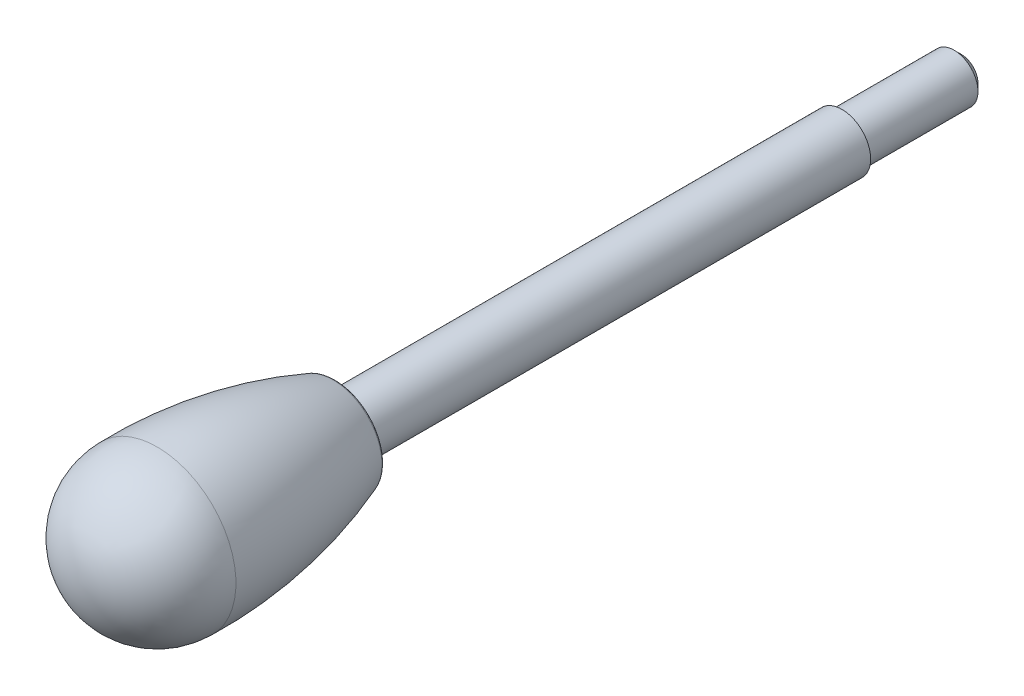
ISO-10303-21;
HEADER;
FILE_DESCRIPTION(('STEP AP214'),'2;1');
FILE_NAME('part.step','',(''),(''),'','','');
FILE_SCHEMA(('AUTOMOTIVE_DESIGN { 1 0 10303 214 1 1 1 1 }'));
ENDSEC;
DATA;
#1=APPLICATION_CONTEXT('core data for automotive mechanical design processes');
#2=APPLICATION_PROTOCOL_DEFINITION('international standard','automotive_design',2000,#1);
#3=PRODUCT_CONTEXT('',#1,'mechanical');
#4=PRODUCT('Part','Part','',(#3));
#5=PRODUCT_RELATED_PRODUCT_CATEGORY('part','',(#4));
#6=PRODUCT_DEFINITION_FORMATION('','',#4);
#7=PRODUCT_DEFINITION_CONTEXT('part definition',#1,'design');
#8=PRODUCT_DEFINITION('design','',#6,#7);
#9=PRODUCT_DEFINITION_SHAPE('','',#8);
#10=(LENGTH_UNIT() NAMED_UNIT(*) SI_UNIT(.MILLI.,.METRE.));
#11=(NAMED_UNIT(*) PLANE_ANGLE_UNIT() SI_UNIT($,.RADIAN.));
#12=(NAMED_UNIT(*) SI_UNIT($,.STERADIAN.) SOLID_ANGLE_UNIT());
#13=UNCERTAINTY_MEASURE_WITH_UNIT(LENGTH_MEASURE(1.E-05),#10,'distance_accuracy_value','');
#14=(GEOMETRIC_REPRESENTATION_CONTEXT(3) GLOBAL_UNCERTAINTY_ASSIGNED_CONTEXT((#13)) GLOBAL_UNIT_ASSIGNED_CONTEXT((#10,
#11,#12)) REPRESENTATION_CONTEXT('',''));
#15=CARTESIAN_POINT('',(0.,0.,0.));
#16=DIRECTION('',(0.,0.,1.));
#17=DIRECTION('',(1.,0.,0.));
#18=AXIS2_PLACEMENT_3D('',#15,#16,#17);
#19=CARTESIAN_POINT('',(0.,0.,143.5));
#20=DIRECTION('',(-1.,0.,0.));
#21=DIRECTION('',(0.,0.,1.));
#22=AXIS2_PLACEMENT_3D('',#19,#20,#21);
#23=SPHERICAL_SURFACE('',#22,16.5);
#24=CARTESIAN_POINT('',(0.,0.,143.5));
#25=DIRECTION('',(0.,0.,-1.));
#26=DIRECTION('',(-1.,0.,0.));
#27=AXIS2_PLACEMENT_3D('',#24,#25,#26);
#28=SPHERICAL_SURFACE('',#27,16.5);
#29=CARTESIAN_POINT('',(0.,0.,143.5));
#30=DIRECTION('',(0.,0.,-1.));
#31=DIRECTION('',(-1.,0.,0.));
#32=AXIS2_PLACEMENT_3D('',#29,#30,#31);
#33=CIRCLE('',#32,16.5);
#34=CARTESIAN_POINT('',(-16.5,0.,143.5));
#35=VERTEX_POINT('',#34);
#36=EDGE_CURVE('E8',#35,#35,#33,.T.);
#37=ORIENTED_EDGE('',*,*,#36,.F.);
#38=EDGE_LOOP('',(#37));
#39=FACE_BOUND('',#38,.T.);
#40=ADVANCED_FACE('F12',(#39),#28,.T.);
#41=CARTESIAN_POINT('',(0.,0.,141.603564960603));
#42=DIRECTION('',(0.,0.,-1.));
#43=DIRECTION('',(-1.,0.,0.));
#44=AXIS2_PLACEMENT_3D('',#41,#42,#43);
#45=DEGENERATE_TOROIDAL_SURFACE('',#44,83.9821055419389,100.5,.F.);
#46=CARTESIAN_POINT('',(0.,0.,106.652225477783));
#47=DIRECTION('',(0.,0.,-1.));
#48=DIRECTION('',(-1.,0.,0.));
#49=AXIS2_PLACEMENT_3D('',#46,#47,#48);
#50=CIRCLE('',#49,10.2445035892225);
#51=CARTESIAN_POINT('',(-10.2445035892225,0.,106.652225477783));
#52=VERTEX_POINT('',#51);
#53=EDGE_CURVE('E18',#52,#52,#50,.T.);
#54=ORIENTED_EDGE('',*,*,#53,.F.);
#55=EDGE_LOOP('',(#54));
#56=FACE_BOUND('',#55,.T.);
#57=ORIENTED_EDGE('',*,*,#36,.T.);
#58=EDGE_LOOP('',(#57));
#59=FACE_BOUND('',#58,.T.);
#60=ADVANCED_FACE('F78',(#56,#59),#45,.F.);
#61=CARTESIAN_POINT('',(0.,0.,107.));
#62=DIRECTION('',(0.,0.,-1.));
#63=DIRECTION('',(-1.,0.,0.));
#64=AXIS2_PLACEMENT_3D('',#61,#62,#63);
#65=TOROIDAL_SURFACE('',#64,9.30692538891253,1.);
#66=CARTESIAN_POINT('',(0.,0.,106.));
#67=DIRECTION('',(0.,0.,-1.));
#68=DIRECTION('',(-1.,0.,0.));
#69=AXIS2_PLACEMENT_3D('',#66,#67,#68);
#70=CIRCLE('',#69,9.30692538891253);
#71=CARTESIAN_POINT('',(-9.30692538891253,0.,106.));
#72=VERTEX_POINT('',#71);
#73=EDGE_CURVE('E22',#72,#72,#70,.T.);
#74=ORIENTED_EDGE('',*,*,#73,.F.);
#75=EDGE_LOOP('',(#74));
#76=FACE_BOUND('',#75,.T.);
#77=ORIENTED_EDGE('',*,*,#53,.T.);
#78=EDGE_LOOP('',(#77));
#79=FACE_BOUND('',#78,.T.);
#80=ADVANCED_FACE('F73',(#76,#79),#65,.T.);
#81=CARTESIAN_POINT('',(0.,9.30692538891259,106.));
#82=DIRECTION('',(0.,0.,1.));
#83=DIRECTION('',(1.,0.,0.));
#84=AXIS2_PLACEMENT_3D('',#81,#82,#83);
#85=PLANE('',#84);
#86=CARTESIAN_POINT('',(0.,0.,106.));
#87=DIRECTION('',(0.,0.,-1.));
#88=DIRECTION('',(-1.,0.,0.));
#89=AXIS2_PLACEMENT_3D('',#86,#87,#88);
#90=CIRCLE('',#89,6.);
#91=CARTESIAN_POINT('',(-6.,0.,106.));
#92=VERTEX_POINT('',#91);
#93=EDGE_CURVE('E26',#92,#92,#90,.T.);
#94=ORIENTED_EDGE('',*,*,#93,.F.);
#95=EDGE_LOOP('',(#94));
#96=FACE_BOUND('',#95,.T.);
#97=ORIENTED_EDGE('',*,*,#73,.T.);
#98=EDGE_LOOP('',(#97));
#99=FACE_BOUND('',#98,.T.);
#100=ADVANCED_FACE('F67',(#96,#99),#85,.F.);
#101=CARTESIAN_POINT('',(0.,0.,-34.4800201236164));
#102=DIRECTION('',(0.,0.,-1.));
#103=DIRECTION('',(-1.,0.,0.));
#104=AXIS2_PLACEMENT_3D('',#101,#102,#103);
#105=CYLINDRICAL_SURFACE('',#104,6.);
#106=CARTESIAN_POINT('',(0.,0.,0.));
#107=DIRECTION('',(0.,0.,-1.));
#108=DIRECTION('',(-1.,0.,0.));
#109=AXIS2_PLACEMENT_3D('',#106,#107,#108);
#110=CIRCLE('',#109,6.);
#111=CARTESIAN_POINT('',(-6.,0.,0.));
#112=VERTEX_POINT('',#111);
#113=EDGE_CURVE('E31',#112,#112,#110,.T.);
#114=ORIENTED_EDGE('',*,*,#113,.F.);
#115=EDGE_LOOP('',(#114));
#116=FACE_BOUND('',#115,.T.);
#117=ORIENTED_EDGE('',*,*,#93,.T.);
#118=EDGE_LOOP('',(#117));
#119=FACE_BOUND('',#118,.T.);
#120=ADVANCED_FACE('F61',(#116,#119),#105,.T.);
#121=CARTESIAN_POINT('',(0.,6.,0.));
#122=DIRECTION('',(0.,0.,1.));
#123=DIRECTION('',(1.,0.,0.));
#124=AXIS2_PLACEMENT_3D('',#121,#122,#123);
#125=PLANE('',#124);
#126=CARTESIAN_POINT('',(0.,0.,0.));
#127=DIRECTION('',(0.,0.,-1.));
#128=DIRECTION('',(-1.,0.,0.));
#129=AXIS2_PLACEMENT_3D('',#126,#127,#128);
#130=CIRCLE('',#129,5.);
#131=CARTESIAN_POINT('',(-5.,0.,0.));
#132=VERTEX_POINT('',#131);
#133=EDGE_CURVE('E34',#132,#132,#130,.T.);
#134=ORIENTED_EDGE('',*,*,#133,.F.);
#135=EDGE_LOOP('',(#134));
#136=FACE_BOUND('',#135,.T.);
#137=ORIENTED_EDGE('',*,*,#113,.T.);
#138=EDGE_LOOP('',(#137));
#139=FACE_BOUND('',#138,.T.);
#140=ADVANCED_FACE('F55',(#136,#139),#125,.F.);
#141=CARTESIAN_POINT('',(0.,0.,-34.4800201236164));
#142=DIRECTION('',(0.,0.,-1.));
#143=DIRECTION('',(-1.,0.,0.));
#144=AXIS2_PLACEMENT_3D('',#141,#142,#143);
#145=CYLINDRICAL_SURFACE('',#144,5.);
#146=CARTESIAN_POINT('',(0.,0.,-23.5));
#147=DIRECTION('',(0.,0.,-1.));
#148=DIRECTION('',(-1.,0.,0.));
#149=AXIS2_PLACEMENT_3D('',#146,#147,#148);
#150=CIRCLE('',#149,5.);
#151=CARTESIAN_POINT('',(-5.,0.,-23.5));
#152=VERTEX_POINT('',#151);
#153=EDGE_CURVE('E37',#152,#152,#150,.T.);
#154=ORIENTED_EDGE('',*,*,#153,.F.);
#155=EDGE_LOOP('',(#154));
#156=FACE_BOUND('',#155,.T.);
#157=ORIENTED_EDGE('',*,*,#133,.T.);
#158=EDGE_LOOP('',(#157));
#159=FACE_BOUND('',#158,.T.);
#160=ADVANCED_FACE('F49',(#156,#159),#145,.T.);
#161=CARTESIAN_POINT('',(0.,0.,-23.5));
#162=DIRECTION('',(0.,0.,1.));
#163=DIRECTION('',(1.,0.,0.));
#164=AXIS2_PLACEMENT_3D('',#161,#162,#163);
#165=CONICAL_SURFACE('',#164,5.,0.785398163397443);
#166=CARTESIAN_POINT('',(0.,0.,-25.));
#167=DIRECTION('',(0.,0.,-1.));
#168=DIRECTION('',(-1.,0.,0.));
#169=AXIS2_PLACEMENT_3D('',#166,#167,#168);
#170=CIRCLE('',#169,3.5);
#171=CARTESIAN_POINT('',(-3.5,0.,-25.));
#172=VERTEX_POINT('',#171);
#173=EDGE_CURVE('E40',#172,#172,#170,.T.);
#174=ORIENTED_EDGE('',*,*,#173,.F.);
#175=EDGE_LOOP('',(#174));
#176=FACE_BOUND('',#175,.T.);
#177=ORIENTED_EDGE('',*,*,#153,.T.);
#178=EDGE_LOOP('',(#177));
#179=FACE_BOUND('',#178,.T.);
#180=ADVANCED_FACE('F46',(#176,#179),#165,.T.);
#181=CARTESIAN_POINT('',(0.,3.5,-25.));
#182=DIRECTION('',(0.,0.,1.));
#183=DIRECTION('',(1.,0.,0.));
#184=AXIS2_PLACEMENT_3D('',#181,#182,#183);
#185=PLANE('',#184);
#186=ORIENTED_EDGE('',*,*,#173,.T.);
#187=EDGE_LOOP('',(#186));
#188=FACE_BOUND('',#187,.T.);
#189=ADVANCED_FACE('F44',(#188),#185,.F.);
#190=CLOSED_SHELL('',(#40,#60,#80,#100,#120,#140,#160,#180,#189));
#191=MANIFOLD_SOLID_BREP('B1',#190);
#192=ADVANCED_BREP_SHAPE_REPRESENTATION('',(#18,#191),#14);
#193=SHAPE_DEFINITION_REPRESENTATION(#9,#192);
ENDSEC;
END-ISO-10303-21;
